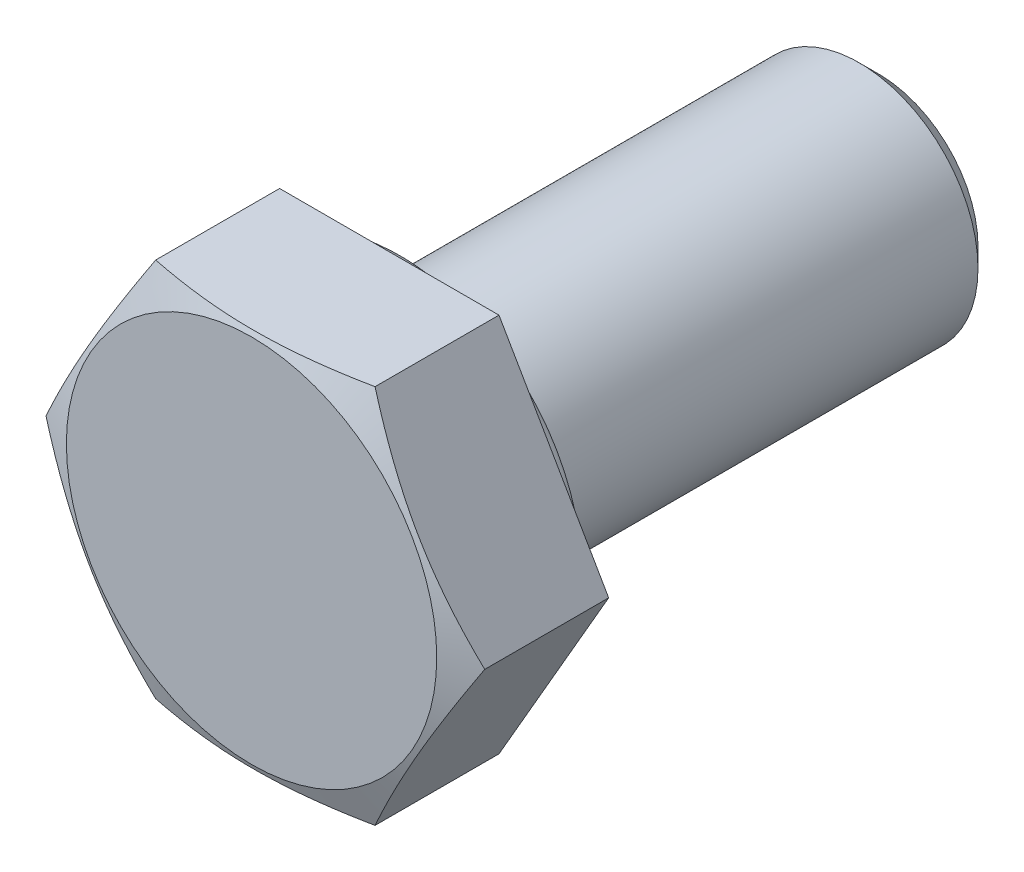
ISO-10303-21;
HEADER;
FILE_DESCRIPTION(('STEP AP214'),'2;1');
FILE_NAME('part.step','',(''),(''),'','','');
FILE_SCHEMA(('AUTOMOTIVE_DESIGN { 1 0 10303 214 1 1 1 1 }'));
ENDSEC;
DATA;
#1=APPLICATION_CONTEXT('core data for automotive mechanical design processes');
#2=APPLICATION_PROTOCOL_DEFINITION('international standard','automotive_design',2000,#1);
#3=PRODUCT_CONTEXT('',#1,'mechanical');
#4=PRODUCT('Part','Part','',(#3));
#5=PRODUCT_RELATED_PRODUCT_CATEGORY('part','',(#4));
#6=PRODUCT_DEFINITION_FORMATION('','',#4);
#7=PRODUCT_DEFINITION_CONTEXT('part definition',#1,'design');
#8=PRODUCT_DEFINITION('design','',#6,#7);
#9=PRODUCT_DEFINITION_SHAPE('','',#8);
#10=(LENGTH_UNIT() NAMED_UNIT(*) SI_UNIT(.MILLI.,.METRE.));
#11=(NAMED_UNIT(*) PLANE_ANGLE_UNIT() SI_UNIT($,.RADIAN.));
#12=(NAMED_UNIT(*) SI_UNIT($,.STERADIAN.) SOLID_ANGLE_UNIT());
#13=UNCERTAINTY_MEASURE_WITH_UNIT(LENGTH_MEASURE(1.E-05),#10,'distance_accuracy_value','');
#14=(GEOMETRIC_REPRESENTATION_CONTEXT(3) GLOBAL_UNCERTAINTY_ASSIGNED_CONTEXT((#13)) GLOBAL_UNIT_ASSIGNED_CONTEXT((#10,
#11,#12)) REPRESENTATION_CONTEXT('',''));
#15=CARTESIAN_POINT('',(0.,0.,0.));
#16=DIRECTION('',(0.,0.,1.));
#17=DIRECTION('',(1.,0.,0.));
#18=AXIS2_PLACEMENT_3D('',#15,#16,#17);
#19=CARTESIAN_POINT('',(0.,0.,6.4));
#20=DIRECTION('',(0.,0.,1.));
#21=DIRECTION('',(1.,0.,0.));
#22=AXIS2_PLACEMENT_3D('',#19,#20,#21);
#23=CYLINDRICAL_SURFACE('',#22,5.);
#24=CARTESIAN_POINT('',(0.,0.,-19.19));
#25=DIRECTION('',(0.,0.,1.));
#26=DIRECTION('',(1.,0.,0.));
#27=AXIS2_PLACEMENT_3D('',#24,#25,#26);
#28=CIRCLE('',#27,5.);
#29=CARTESIAN_POINT('',(5.,0.,-19.19));
#30=VERTEX_POINT('',#29);
#31=EDGE_CURVE('E9',#30,#30,#28,.T.);
#32=ORIENTED_EDGE('',*,*,#31,.T.);
#33=EDGE_LOOP('',(#32));
#34=FACE_BOUND('',#33,.T.);
#35=CARTESIAN_POINT('',(0.,0.,-1.5));
#36=DIRECTION('',(0.,0.,1.));
#37=DIRECTION('',(1.,0.,0.));
#38=AXIS2_PLACEMENT_3D('',#35,#36,#37);
#39=CIRCLE('',#38,5.);
#40=CARTESIAN_POINT('',(5.,0.,-1.5));
#41=VERTEX_POINT('',#40);
#42=EDGE_CURVE('E69',#41,#41,#39,.T.);
#43=ORIENTED_EDGE('',*,*,#42,.F.);
#44=EDGE_LOOP('',(#43));
#45=FACE_BOUND('',#44,.T.);
#46=ADVANCED_FACE('F14',(#34,#45),#23,.T.);
#47=CARTESIAN_POINT('',(0.,7.835,0.6));
#48=DIRECTION('',(0.,0.,1.));
#49=DIRECTION('',(1.,0.,0.));
#50=AXIS2_PLACEMENT_3D('',#47,#48,#49);
#51=PLANE('',#50);
#52=CARTESIAN_POINT('',(0.,0.,0.6));
#53=DIRECTION('',(0.,0.,1.));
#54=DIRECTION('',(1.,0.,0.));
#55=AXIS2_PLACEMENT_3D('',#52,#53,#54);
#56=CIRCLE('',#55,7.835);
#57=CARTESIAN_POINT('',(7.835,0.,0.6));
#58=VERTEX_POINT('',#57);
#59=EDGE_CURVE('E203',#58,#58,#56,.T.);
#60=ORIENTED_EDGE('',*,*,#59,.T.);
#61=EDGE_LOOP('',(#60));
#62=FACE_BOUND('',#61,.T.);
#63=DIRECTION('',(-1.,0.,0.));
#64=VECTOR('',#63,1.);
#65=CARTESIAN_POINT('',(0.,-7.99999626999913,0.6));
#66=LINE('',#65,#64);
#67=CARTESIAN_POINT('',(4.6188,-7.99999626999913,0.6));
#68=VERTEX_POINT('',#67);
#69=CARTESIAN_POINT('',(-4.6188,-7.99999626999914,0.6));
#70=VERTEX_POINT('',#69);
#71=EDGE_CURVE('E189',#68,#70,#66,.T.);
#72=ORIENTED_EDGE('',*,*,#71,.T.);
#73=DIRECTION('',(-0.5,0.866025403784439,0.));
#74=VECTOR('',#73,1.);
#75=CARTESIAN_POINT('',(-10.3208545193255,1.87625186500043,0.6));
#76=LINE('',#75,#74);
#77=CARTESIAN_POINT('',(-9.2376,0.,0.6));
#78=VERTEX_POINT('',#77);
#79=EDGE_CURVE('E77',#70,#78,#76,.T.);
#80=ORIENTED_EDGE('',*,*,#79,.T.);
#81=DIRECTION('',(0.5,0.866025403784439,0.));
#82=VECTOR('',#81,1.);
#83=CARTESIAN_POINT('',(-3.53554548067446,9.87624813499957,0.6));
#84=LINE('',#83,#82);
#85=CARTESIAN_POINT('',(-4.6188,7.99999626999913,0.6));
#86=VERTEX_POINT('',#85);
#87=EDGE_CURVE('E197',#78,#86,#84,.T.);
#88=ORIENTED_EDGE('',*,*,#87,.T.);
#89=DIRECTION('',(1.,0.,0.));
#90=VECTOR('',#89,1.);
#91=CARTESIAN_POINT('',(0.,7.99999626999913,0.6));
#92=LINE('',#91,#90);
#93=CARTESIAN_POINT('',(4.6188,7.99999626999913,0.6));
#94=VERTEX_POINT('',#93);
#95=EDGE_CURVE('E195',#86,#94,#92,.T.);
#96=ORIENTED_EDGE('',*,*,#95,.T.);
#97=DIRECTION('',(0.5,-0.866025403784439,0.));
#98=VECTOR('',#97,1.);
#99=CARTESIAN_POINT('',(3.53554548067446,9.87624813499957,0.6));
#100=LINE('',#99,#98);
#101=CARTESIAN_POINT('',(9.2376,0.,0.6));
#102=VERTEX_POINT('',#101);
#103=EDGE_CURVE('E180',#94,#102,#100,.T.);
#104=ORIENTED_EDGE('',*,*,#103,.T.);
#105=DIRECTION('',(-0.5,-0.866025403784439,0.));
#106=VECTOR('',#105,1.);
#107=CARTESIAN_POINT('',(10.3208545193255,1.87625186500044,0.6));
#108=LINE('',#107,#106);
#109=EDGE_CURVE('E191',#102,#68,#108,.T.);
#110=ORIENTED_EDGE('',*,*,#109,.T.);
#111=EDGE_LOOP('',(#72,#80,#88,#96,#104,#110));
#112=FACE_BOUND('',#111,.T.);
#113=ADVANCED_FACE('F121',(#62,#112),#51,.F.);
#114=CARTESIAN_POINT('',(0.,5.,-1.5));
#115=DIRECTION('',(0.,0.,-1.));
#116=DIRECTION('',(-1.,0.,0.));
#117=AXIS2_PLACEMENT_3D('',#114,#115,#116);
#118=PLANE('',#117);
#119=CARTESIAN_POINT('',(0.,0.,-1.5));
#120=DIRECTION('',(0.,0.,1.));
#121=DIRECTION('',(1.,0.,0.));
#122=AXIS2_PLACEMENT_3D('',#119,#120,#121);
#123=CIRCLE('',#122,4.188125);
#124=CARTESIAN_POINT('',(4.188125,0.,-1.5));
#125=VERTEX_POINT('',#124);
#126=EDGE_CURVE('E133',#125,#125,#123,.T.);
#127=ORIENTED_EDGE('',*,*,#126,.F.);
#128=EDGE_LOOP('',(#127));
#129=FACE_BOUND('',#128,.T.);
#130=ORIENTED_EDGE('',*,*,#42,.T.);
#131=EDGE_LOOP('',(#130));
#132=FACE_BOUND('',#131,.T.);
#133=ADVANCED_FACE('F126',(#129,#132),#118,.F.);
#134=CARTESIAN_POINT('',(0.,0.,-1.5));
#135=DIRECTION('',(0.,0.,1.));
#136=DIRECTION('',(1.,0.,0.));
#137=AXIS2_PLACEMENT_3D('',#134,#135,#136);
#138=CONICAL_SURFACE('',#137,4.188125,1.0471975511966);
#139=CARTESIAN_POINT('',(0.,0.,-1.03126375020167));
#140=DIRECTION('',(0.,0.,1.));
#141=DIRECTION('',(1.,0.,0.));
#142=AXIS2_PLACEMENT_3D('',#139,#140,#141);
#143=CIRCLE('',#142,5.);
#144=CARTESIAN_POINT('',(5.,0.,-1.03126375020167));
#145=VERTEX_POINT('',#144);
#146=EDGE_CURVE('E136',#145,#145,#143,.T.);
#147=ORIENTED_EDGE('',*,*,#146,.F.);
#148=EDGE_LOOP('',(#147));
#149=FACE_BOUND('',#148,.T.);
#150=ORIENTED_EDGE('',*,*,#126,.T.);
#151=EDGE_LOOP('',(#150));
#152=FACE_BOUND('',#151,.T.);
#153=ADVANCED_FACE('F219',(#149,#152),#138,.T.);
#154=CARTESIAN_POINT('',(0.,0.,6.4));
#155=DIRECTION('',(0.,0.,1.));
#156=DIRECTION('',(1.,0.,0.));
#157=AXIS2_PLACEMENT_3D('',#154,#155,#156);
#158=CYLINDRICAL_SURFACE('',#157,5.);
#159=CARTESIAN_POINT('',(0.,0.,-0.5));
#160=DIRECTION('',(0.,0.,1.));
#161=DIRECTION('',(1.,0.,0.));
#162=AXIS2_PLACEMENT_3D('',#159,#160,#161);
#163=CIRCLE('',#162,5.);
#164=CARTESIAN_POINT('',(5.,0.,-0.5));
#165=VERTEX_POINT('',#164);
#166=EDGE_CURVE('E212',#165,#165,#163,.T.);
#167=ORIENTED_EDGE('',*,*,#166,.F.);
#168=EDGE_LOOP('',(#167));
#169=FACE_BOUND('',#168,.T.);
#170=ORIENTED_EDGE('',*,*,#146,.T.);
#171=EDGE_LOOP('',(#170));
#172=FACE_BOUND('',#171,.T.);
#173=ADVANCED_FACE('F217',(#169,#172),#158,.T.);
#174=CARTESIAN_POINT('',(0.,0.,-0.5));
#175=DIRECTION('',(0.,0.,1.));
#176=DIRECTION('',(1.,0.,0.));
#177=AXIS2_PLACEMENT_3D('',#174,#175,#176);
#178=TOROIDAL_SURFACE('',#177,5.5,0.5);
#179=ORIENTED_EDGE('',*,*,#166,.T.);
#180=EDGE_LOOP('',(#179));
#181=FACE_BOUND('',#180,.T.);
#182=CARTESIAN_POINT('',(0.,0.,0.));
#183=DIRECTION('',(0.,0.,1.));
#184=DIRECTION('',(1.,0.,0.));
#185=AXIS2_PLACEMENT_3D('',#182,#183,#184);
#186=CIRCLE('',#185,5.5);
#187=CARTESIAN_POINT('',(5.5,0.,0.));
#188=VERTEX_POINT('',#187);
#189=EDGE_CURVE('E209',#188,#188,#186,.T.);
#190=ORIENTED_EDGE('',*,*,#189,.F.);
#191=EDGE_LOOP('',(#190));
#192=FACE_BOUND('',#191,.T.);
#193=ADVANCED_FACE('F231',(#181,#192),#178,.F.);
#194=CARTESIAN_POINT('',(0.,5.5,0.));
#195=DIRECTION('',(0.,0.,1.));
#196=DIRECTION('',(1.,0.,0.));
#197=AXIS2_PLACEMENT_3D('',#194,#195,#196);
#198=PLANE('',#197);
#199=CARTESIAN_POINT('',(0.,0.,0.));
#200=DIRECTION('',(0.,0.,1.));
#201=DIRECTION('',(1.,0.,0.));
#202=AXIS2_PLACEMENT_3D('',#199,#200,#201);
#203=CIRCLE('',#202,7.235);
#204=CARTESIAN_POINT('',(7.235,0.,0.));
#205=VERTEX_POINT('',#204);
#206=EDGE_CURVE('E206',#205,#205,#203,.T.);
#207=ORIENTED_EDGE('',*,*,#206,.F.);
#208=EDGE_LOOP('',(#207));
#209=FACE_BOUND('',#208,.T.);
#210=ORIENTED_EDGE('',*,*,#189,.T.);
#211=EDGE_LOOP('',(#210));
#212=FACE_BOUND('',#211,.T.);
#213=ADVANCED_FACE('F235',(#209,#212),#198,.F.);
#214=CARTESIAN_POINT('',(0.,0.,0.6));
#215=DIRECTION('',(0.,0.,1.));
#216=DIRECTION('',(1.,0.,0.));
#217=AXIS2_PLACEMENT_3D('',#214,#215,#216);
#218=TOROIDAL_SURFACE('',#217,7.235,0.6);
#219=ORIENTED_EDGE('',*,*,#59,.F.);
#220=EDGE_LOOP('',(#219));
#221=FACE_BOUND('',#220,.T.);
#222=ORIENTED_EDGE('',*,*,#206,.T.);
#223=EDGE_LOOP('',(#222));
#224=FACE_BOUND('',#223,.T.);
#225=ADVANCED_FACE('F104',(#221,#224),#218,.T.);
#226=CARTESIAN_POINT('',(-4.6188,-7.99999626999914,-25.));
#227=DIRECTION('',(0.866025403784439,0.5,0.));
#228=DIRECTION('',(0.5,-0.866025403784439,0.));
#229=AXIS2_PLACEMENT_3D('',#226,#227,#228);
#230=PLANE('',#229);
#231=ORIENTED_EDGE('',*,*,#79,.F.);
#232=DIRECTION('',(0.,0.,1.));
#233=VECTOR('',#232,1.);
#234=CARTESIAN_POINT('',(-4.6188,-7.99999626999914,-25.));
#235=LINE('',#234,#233);
#236=CARTESIAN_POINT('',(-4.6188,-7.99999626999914,5.81818181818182));
#237=VERTEX_POINT('',#236);
#238=EDGE_CURVE('E28',#70,#237,#235,.T.);
#239=ORIENTED_EDGE('',*,*,#238,.T.);
#240=CARTESIAN_POINT('',(-9.23760011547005,2.E-07,5.81818177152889));
#241=CARTESIAN_POINT('',(-9.07623171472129,-0.27949806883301,5.88338258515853));
#242=CARTESIAN_POINT('',(-8.91433070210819,-0.559918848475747,5.94367122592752));
#243=CARTESIAN_POINT('',(-8.58945812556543,-1.12261465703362,6.0525711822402));
#244=CARTESIAN_POINT('',(-8.42648599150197,-1.40489067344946,6.10117565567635));
#245=CARTESIAN_POINT('',(-8.09970314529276,-1.97089516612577,6.184761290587));
#246=CARTESIAN_POINT('',(-7.93589269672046,-2.25462318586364,6.21974649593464));
#247=CARTESIAN_POINT('',(-7.60766331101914,-2.82313315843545,6.27447232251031));
#248=CARTESIAN_POINT('',(-7.44324451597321,-3.10791486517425,6.2942163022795));
#249=CARTESIAN_POINT('',(-7.116909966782,-3.67314288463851,6.31723187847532));
#250=CARTESIAN_POINT('',(-6.95499911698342,-3.95358070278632,6.3207774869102));
#251=CARTESIAN_POINT('',(-6.63127309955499,-4.51429061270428,6.31195075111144));
#252=CARTESIAN_POINT('',(-6.46945794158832,-4.79456268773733,6.29957700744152));
#253=CARTESIAN_POINT('',(-6.14641204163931,-5.35409459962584,6.25957675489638));
#254=CARTESIAN_POINT('',(-5.98518099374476,-5.63335496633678,6.23195993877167));
#255=CARTESIAN_POINT('',(-5.66348869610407,-6.19054237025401,6.16281191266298));
#256=CARTESIAN_POINT('',(-5.50302737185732,-6.46846953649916,6.12128207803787));
#257=CARTESIAN_POINT('',(-5.28250881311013,-6.85041888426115,6.05563542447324));
#258=CARTESIAN_POINT('',(-5.22204978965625,-6.95513698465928,6.03674445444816));
#259=CARTESIAN_POINT('',(-5.10127443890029,-7.16432602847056,5.99731748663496));
#260=CARTESIAN_POINT('',(-5.04095809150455,-7.26879700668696,5.9767817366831));
#261=CARTESIAN_POINT('',(-4.92025661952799,-7.4778580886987,5.93408711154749));
#262=CARTESIAN_POINT('',(-4.85987196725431,-7.5824473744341,5.91192291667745));
#263=CARTESIAN_POINT('',(-4.73923496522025,-7.79139679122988,5.86612783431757));
#264=CARTESIAN_POINT('',(-4.67898263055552,-7.89575689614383,5.84249678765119));
#265=CARTESIAN_POINT('',(-4.61879988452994,-7.99999646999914,5.81818177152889));
#266=B_SPLINE_CURVE_WITH_KNOTS('',3,(#240,#241,#242,#243,#244,#245,#246,#247,#248,#249,#250,
#251,#252,#253,#254,#255,#256,#257,#258,#259,#260,#261,#262,#263,#264,#265),.UNSPECIFIED.,.F.,
.F.,(4,2,2,2,2,2,2,2,2,2,2,2,4),(0.,0.987840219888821,1.97625750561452,2.96438108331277,
3.95228685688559,4.92341776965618,5.89463405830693,6.86523348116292,7.83573698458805,
8.20288448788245,8.56997677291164,8.93832669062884,9.30671665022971),.UNSPECIFIED.);
#267=CARTESIAN_POINT('',(-9.2376,0.,5.81818181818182));
#268=VERTEX_POINT('',#267);
#269=EDGE_CURVE('E74',#268,#237,#266,.T.);
#270=ORIENTED_EDGE('',*,*,#269,.F.);
#271=DIRECTION('',(0.,0.,1.));
#272=VECTOR('',#271,1.);
#273=CARTESIAN_POINT('',(-9.2376,0.,-25.));
#274=LINE('',#273,#272);
#275=EDGE_CURVE('E183',#78,#268,#274,.T.);
#276=ORIENTED_EDGE('',*,*,#275,.F.);
#277=EDGE_LOOP('',(#231,#239,#270,#276));
#278=FACE_BOUND('',#277,.T.);
#279=ADVANCED_FACE('F72',(#278),#230,.F.);
#280=CARTESIAN_POINT('',(-9.2376,0.,-25.));
#281=DIRECTION('',(0.866025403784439,-0.5,0.));
#282=DIRECTION('',(-0.5,-0.866025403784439,0.));
#283=AXIS2_PLACEMENT_3D('',#280,#281,#282);
#284=PLANE('',#283);
#285=ORIENTED_EDGE('',*,*,#87,.F.);
#286=ORIENTED_EDGE('',*,*,#275,.T.);
#287=CARTESIAN_POINT('',(-4.61879988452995,7.99999646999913,5.81818177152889));
#288=CARTESIAN_POINT('',(-4.78016828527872,7.72049820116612,5.88338258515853));
#289=CARTESIAN_POINT('',(-4.94206929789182,7.44007742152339,5.94367122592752));
#290=CARTESIAN_POINT('',(-5.26694187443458,6.87738161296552,6.0525711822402));
#291=CARTESIAN_POINT('',(-5.42991400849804,6.59510559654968,6.10117565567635));
#292=CARTESIAN_POINT('',(-5.75669685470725,6.02910110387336,6.184761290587));
#293=CARTESIAN_POINT('',(-5.92050730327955,5.7453730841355,6.21974649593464));
#294=CARTESIAN_POINT('',(-6.24873668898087,5.17686311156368,6.27447232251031));
#295=CARTESIAN_POINT('',(-6.4131554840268,4.89208140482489,6.2942163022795));
#296=CARTESIAN_POINT('',(-6.73949003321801,4.32685338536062,6.31723187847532));
#297=CARTESIAN_POINT('',(-6.90140088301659,4.04641556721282,6.3207774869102));
#298=CARTESIAN_POINT('',(-7.22512690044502,3.48570565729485,6.31195075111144));
#299=CARTESIAN_POINT('',(-7.38694205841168,3.20543358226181,6.29957700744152));
#300=CARTESIAN_POINT('',(-7.7099879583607,2.64590167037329,6.25957675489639));
#301=CARTESIAN_POINT('',(-7.87121900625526,2.36664130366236,6.23195993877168));
#302=CARTESIAN_POINT('',(-8.19291130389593,1.80945389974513,6.16281191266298));
#303=CARTESIAN_POINT('',(-8.35337262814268,1.53152673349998,6.12128207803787));
#304=CARTESIAN_POINT('',(-8.57389118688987,1.14957738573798,6.05563542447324));
#305=CARTESIAN_POINT('',(-8.63435021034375,1.04485928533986,6.03674445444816));
#306=CARTESIAN_POINT('',(-8.75512556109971,0.835670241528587,5.99731748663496));
#307=CARTESIAN_POINT('',(-8.81544190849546,0.731199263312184,5.9767817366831));
#308=CARTESIAN_POINT('',(-8.93614338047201,0.52213818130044,5.93408711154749));
#309=CARTESIAN_POINT('',(-8.99652803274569,0.417548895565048,5.91192291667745));
#310=CARTESIAN_POINT('',(-9.11716503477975,0.208599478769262,5.86612783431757));
#311=CARTESIAN_POINT('',(-9.17741736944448,0.104239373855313,5.84249678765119));
#312=CARTESIAN_POINT('',(-9.23760011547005,-1.99999999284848E-07,5.81818177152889));
#313=B_SPLINE_CURVE_WITH_KNOTS('',3,(#287,#288,#289,#290,#291,#292,#293,#294,#295,#296,#297,
#298,#299,#300,#301,#302,#303,#304,#305,#306,#307,#308,#309,#310,#311,#312),.UNSPECIFIED.,.F.,
.F.,(4,2,2,2,2,2,2,2,2,2,2,2,4),(0.,0.987840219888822,1.97625750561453,2.96438108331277,
3.95228685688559,4.92341776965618,5.89463405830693,6.86523348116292,7.83573698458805,
8.20288448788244,8.56997677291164,8.93832669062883,9.3067166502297),.UNSPECIFIED.);
#314=CARTESIAN_POINT('',(-4.6188,7.99999626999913,5.81818181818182));
#315=VERTEX_POINT('',#314);
#316=EDGE_CURVE('E83',#315,#268,#313,.T.);
#317=ORIENTED_EDGE('',*,*,#316,.F.);
#318=DIRECTION('',(0.,0.,1.));
#319=VECTOR('',#318,1.);
#320=CARTESIAN_POINT('',(-4.6188,7.99999626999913,-25.));
#321=LINE('',#320,#319);
#322=EDGE_CURVE('E176',#86,#315,#321,.T.);
#323=ORIENTED_EDGE('',*,*,#322,.F.);
#324=EDGE_LOOP('',(#285,#286,#317,#323));
#325=FACE_BOUND('',#324,.T.);
#326=ADVANCED_FACE('F103',(#325),#284,.F.);
#327=CARTESIAN_POINT('',(-4.6188,7.99999626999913,-25.));
#328=DIRECTION('',(0.,-1.,0.));
#329=DIRECTION('',(-1.,0.,0.));
#330=AXIS2_PLACEMENT_3D('',#327,#328,#329);
#331=PLANE('',#330);
#332=ORIENTED_EDGE('',*,*,#95,.F.);
#333=ORIENTED_EDGE('',*,*,#322,.T.);
#334=CARTESIAN_POINT('',(-12.5719547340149,7.99999626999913,3.5298273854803));
#335=CARTESIAN_POINT('',(-12.1983187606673,7.99999626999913,3.65714990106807));
#336=CARTESIAN_POINT('',(-11.8241969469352,7.99999626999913,3.78307295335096));
#337=CARTESIAN_POINT('',(-11.0747197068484,7.99999626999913,4.03131289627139));
#338=CARTESIAN_POINT('',(-10.6993641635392,7.99999626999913,4.15362943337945));
#339=CARTESIAN_POINT('',(-9.94620503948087,7.99999626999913,4.39415137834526));
#340=CARTESIAN_POINT('',(-9.56839757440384,7.99999626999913,4.51234466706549));
#341=CARTESIAN_POINT('',(-8.81107863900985,7.99999626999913,4.74312776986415));
#342=CARTESIAN_POINT('',(-8.43156721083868,7.99999626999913,4.8557177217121));
#343=CARTESIAN_POINT('',(-7.67246142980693,7.99999626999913,5.07327543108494));
#344=CARTESIAN_POINT('',(-7.29287748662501,7.99999626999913,5.17827932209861));
#345=CARTESIAN_POINT('',(-6.53133965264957,7.99999626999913,5.37943691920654));
#346=CARTESIAN_POINT('',(-6.14938567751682,7.99999626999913,5.47559030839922));
#347=CARTESIAN_POINT('',(-5.38308686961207,7.99999626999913,5.65661961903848));
#348=CARTESIAN_POINT('',(-4.99874399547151,7.99999626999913,5.74150375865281));
#349=CARTESIAN_POINT('',(-4.22720948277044,7.99999626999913,5.89721151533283));
#350=CARTESIAN_POINT('',(-3.84001810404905,7.99999626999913,5.96803639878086));
#351=CARTESIAN_POINT('',(-3.15468340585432,7.99999626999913,6.07772100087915));
#352=CARTESIAN_POINT('',(-2.85711851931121,7.99999626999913,6.12017938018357));
#353=CARTESIAN_POINT('',(-2.26056309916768,7.99999626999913,6.19360511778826));
#354=CARTESIAN_POINT('',(-1.9615726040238,7.99999626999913,6.22457278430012));
#355=CARTESIAN_POINT('',(-1.36269467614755,7.99999626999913,6.27378877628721));
#356=CARTESIAN_POINT('',(-1.06280781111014,7.99999626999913,6.29204392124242));
#357=CARTESIAN_POINT('',(-0.462511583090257,7.99999626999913,6.31505964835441));
#358=CARTESIAN_POINT('',(-0.162102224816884,7.99999626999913,6.31982035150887));
#359=CARTESIAN_POINT('',(0.438718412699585,7.99999626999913,6.31562600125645));
#360=CARTESIAN_POINT('',(0.739129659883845,7.99999626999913,6.30666642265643));
#361=CARTESIAN_POINT('',(1.33925291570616,7.99999626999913,6.27543464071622));
#362=CARTESIAN_POINT('',(1.63896491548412,7.99999626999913,6.25316226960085));
#363=CARTESIAN_POINT('',(2.23737206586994,7.99999626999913,6.19623962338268));
#364=CARTESIAN_POINT('',(2.53606652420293,7.99999626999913,6.16158216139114));
#365=CARTESIAN_POINT('',(3.13194924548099,7.99999626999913,6.08119272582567));
#366=CARTESIAN_POINT('',(3.42913747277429,7.99999626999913,6.03546049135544));
#367=CARTESIAN_POINT('',(4.11363187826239,7.99999626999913,5.91871471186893));
#368=CARTESIAN_POINT('',(4.50034816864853,7.99999626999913,5.84425774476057));
#369=CARTESIAN_POINT('',(5.27095740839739,7.99999626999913,5.68198807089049));
#370=CARTESIAN_POINT('',(5.65485012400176,7.99999626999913,5.59417427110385));
#371=CARTESIAN_POINT('',(6.42025470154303,7.99999626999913,5.40788960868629));
#372=CARTESIAN_POINT('',(6.80176506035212,7.99999626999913,5.30941262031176));
#373=CARTESIAN_POINT('',(7.56249587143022,7.99999626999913,5.10408437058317));
#374=CARTESIAN_POINT('',(7.94171640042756,7.99999626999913,4.99723339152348));
#375=CARTESIAN_POINT('',(8.69926332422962,7.99999626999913,4.77660865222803));
#376=CARTESIAN_POINT('',(9.07758437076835,7.99999626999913,4.66281661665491));
#377=CARTESIAN_POINT('',(9.83259783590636,7.99999626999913,4.42994140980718));
#378=CARTESIAN_POINT('',(10.2092902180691,7.99999626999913,4.31085812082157));
#379=CARTESIAN_POINT('',(10.9604179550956,7.99999626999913,4.06875367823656));
#380=CARTESIAN_POINT('',(11.3348565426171,7.99999626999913,3.94574252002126));
#381=CARTESIAN_POINT('',(12.0825558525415,7.99999626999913,3.69629462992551));
#382=CARTESIAN_POINT('',(12.4558166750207,7.99999626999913,3.56985819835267));
#383=CARTESIAN_POINT('',(12.8286123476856,7.99999626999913,3.44208796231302));
#384=B_SPLINE_CURVE_WITH_KNOTS('',3,(#334,#335,#336,#337,#338,#339,#340,#341,#342,#343,#344,
#345,#346,#347,#348,#349,#350,#351,#352,#353,#354,#355,#356,#357,#358,#359,#360,#361,#362,#363,
#364,#365,#366,#367,#368,#369,#370,#371,#372,#373,#374,#375,#376,#377,#378,#379,#380,#381,#382,
#383),.UNSPECIFIED.,.F.,.F.,(4,2,2,2,2,2,2,2,2,2,2,2,2,2,2,2,2,2,2,2,2,2,2,2,4),(0.,
1.18421166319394,2.36853902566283,3.55609567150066,4.74362310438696,5.92505950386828,
7.10653818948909,8.28715048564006,9.46765639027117,10.3692009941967,11.2707214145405,
12.1717578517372,13.0727862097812,13.9741118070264,14.8754487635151,15.777309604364,
16.6791916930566,17.8603375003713,19.0415800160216,20.2235047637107,21.4053896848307,
22.5905333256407,23.7757033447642,24.9580661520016,26.1403256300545),.UNSPECIFIED.);
#385=CARTESIAN_POINT('',(4.6188,7.99999626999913,5.81818181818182));
#386=VERTEX_POINT('',#385);
#387=EDGE_CURVE('E86',#386,#315,#384,.F.);
#388=ORIENTED_EDGE('',*,*,#387,.F.);
#389=DIRECTION('',(0.,0.,1.));
#390=VECTOR('',#389,1.);
#391=CARTESIAN_POINT('',(4.6188,7.99999626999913,-25.));
#392=LINE('',#391,#390);
#393=EDGE_CURVE('E173',#94,#386,#392,.T.);
#394=ORIENTED_EDGE('',*,*,#393,.F.);
#395=EDGE_LOOP('',(#332,#333,#388,#394));
#396=FACE_BOUND('',#395,.T.);
#397=ADVANCED_FACE('F158',(#396),#331,.F.);
#398=CARTESIAN_POINT('',(4.6188,7.99999626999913,-25.));
#399=DIRECTION('',(-0.866025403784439,-0.5,0.));
#400=DIRECTION('',(-0.5,0.866025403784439,0.));
#401=AXIS2_PLACEMENT_3D('',#398,#399,#400);
#402=PLANE('',#401);
#403=ORIENTED_EDGE('',*,*,#103,.F.);
#404=ORIENTED_EDGE('',*,*,#393,.T.);
#405=CARTESIAN_POINT('',(9.23760011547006,-2.00000002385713E-07,5.81818177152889));
#406=CARTESIAN_POINT('',(9.07623171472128,0.279498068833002,5.88338258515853));
#407=CARTESIAN_POINT('',(8.91433070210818,0.559918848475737,5.94367122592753));
#408=CARTESIAN_POINT('',(8.58945812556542,1.12261465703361,6.0525711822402));
#409=CARTESIAN_POINT('',(8.42648599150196,1.40489067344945,6.10117565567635));
#410=CARTESIAN_POINT('',(8.09970314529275,1.97089516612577,6.18476129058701));
#411=CARTESIAN_POINT('',(7.93589269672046,2.25462318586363,6.21974649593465));
#412=CARTESIAN_POINT('',(7.60766331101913,2.82313315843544,6.27447232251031));
#413=CARTESIAN_POINT('',(7.44324451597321,3.10791486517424,6.29421630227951));
#414=CARTESIAN_POINT('',(7.116909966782,3.67314288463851,6.31723187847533));
#415=CARTESIAN_POINT('',(6.95499911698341,3.95358070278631,6.3207774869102));
#416=CARTESIAN_POINT('',(6.63127309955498,4.51429061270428,6.31195075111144));
#417=CARTESIAN_POINT('',(6.46945794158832,4.79456268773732,6.29957700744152));
#418=CARTESIAN_POINT('',(6.1464120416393,5.35409459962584,6.25957675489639));
#419=CARTESIAN_POINT('',(5.98518099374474,5.63335496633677,6.23195993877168));
#420=CARTESIAN_POINT('',(5.66348869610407,6.19054237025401,6.16281191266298));
#421=CARTESIAN_POINT('',(5.50302737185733,6.46846953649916,6.12128207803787));
#422=CARTESIAN_POINT('',(5.28250881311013,6.85041888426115,6.05563542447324));
#423=CARTESIAN_POINT('',(5.22204978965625,6.95513698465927,6.03674445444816));
#424=CARTESIAN_POINT('',(5.10127443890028,7.16432602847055,5.99731748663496));
#425=CARTESIAN_POINT('',(5.04095809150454,7.26879700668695,5.97678173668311));
#426=CARTESIAN_POINT('',(4.92025661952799,7.47785808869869,5.93408711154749));
#427=CARTESIAN_POINT('',(4.85987196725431,7.58244737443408,5.91192291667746));
#428=CARTESIAN_POINT('',(4.73923496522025,7.79139679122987,5.86612783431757));
#429=CARTESIAN_POINT('',(4.67898263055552,7.89575689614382,5.8424967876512));
#430=CARTESIAN_POINT('',(4.61879988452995,7.99999646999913,5.81818177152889));
#431=B_SPLINE_CURVE_WITH_KNOTS('',3,(#405,#406,#407,#408,#409,#410,#411,#412,#413,#414,#415,
#416,#417,#418,#419,#420,#421,#422,#423,#424,#425,#426,#427,#428,#429,#430),.UNSPECIFIED.,.F.,
.F.,(4,2,2,2,2,2,2,2,2,2,2,2,4),(0.,0.987840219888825,1.97625750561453,2.96438108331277,
3.95228685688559,4.92341776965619,5.89463405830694,6.86523348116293,7.83573698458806,
8.20288448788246,8.56997677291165,8.93832669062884,9.30671665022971),.UNSPECIFIED.);
#432=CARTESIAN_POINT('',(9.2376,0.,5.81818181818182));
#433=VERTEX_POINT('',#432);
#434=EDGE_CURVE('E161',#433,#386,#431,.T.);
#435=ORIENTED_EDGE('',*,*,#434,.F.);
#436=DIRECTION('',(0.,0.,1.));
#437=VECTOR('',#436,1.);
#438=CARTESIAN_POINT('',(9.2376,0.,-25.));
#439=LINE('',#438,#437);
#440=EDGE_CURVE('E181',#102,#433,#439,.T.);
#441=ORIENTED_EDGE('',*,*,#440,.F.);
#442=EDGE_LOOP('',(#403,#404,#435,#441));
#443=FACE_BOUND('',#442,.T.);
#444=ADVANCED_FACE('F154',(#443),#402,.F.);
#445=CARTESIAN_POINT('',(9.2376,0.,-25.));
#446=DIRECTION('',(-0.866025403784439,0.5,0.));
#447=DIRECTION('',(0.5,0.866025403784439,0.));
#448=AXIS2_PLACEMENT_3D('',#445,#446,#447);
#449=PLANE('',#448);
#450=ORIENTED_EDGE('',*,*,#109,.F.);
#451=ORIENTED_EDGE('',*,*,#440,.T.);
#452=CARTESIAN_POINT('',(4.61879988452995,-7.99999646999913,5.81818177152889));
#453=CARTESIAN_POINT('',(4.78016828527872,-7.72049820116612,5.88338258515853));
#454=CARTESIAN_POINT('',(4.94206929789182,-7.44007742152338,5.94367122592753));
#455=CARTESIAN_POINT('',(5.26694187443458,-6.87738161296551,6.0525711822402));
#456=CARTESIAN_POINT('',(5.42991400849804,-6.59510559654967,6.10117565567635));
#457=CARTESIAN_POINT('',(5.75669685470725,-6.02910110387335,6.18476129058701));
#458=CARTESIAN_POINT('',(5.92050730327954,-5.74537308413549,6.21974649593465));
#459=CARTESIAN_POINT('',(6.24873668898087,-5.17686311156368,6.27447232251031));
#460=CARTESIAN_POINT('',(6.41315548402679,-4.89208140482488,6.29421630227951));
#461=CARTESIAN_POINT('',(6.739490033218,-4.32685338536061,6.31723187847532));
#462=CARTESIAN_POINT('',(6.90140088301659,-4.0464155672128,6.3207774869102));
#463=CARTESIAN_POINT('',(7.22512690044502,-3.48570565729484,6.31195075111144));
#464=CARTESIAN_POINT('',(7.38694205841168,-3.2054335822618,6.29957700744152));
#465=CARTESIAN_POINT('',(7.7099879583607,-2.64590167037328,6.25957675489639));
#466=CARTESIAN_POINT('',(7.87121900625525,-2.36664130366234,6.23195993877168));
#467=CARTESIAN_POINT('',(8.19291130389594,-1.80945389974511,6.16281191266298));
#468=CARTESIAN_POINT('',(8.35337262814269,-1.53152673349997,6.12128207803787));
#469=CARTESIAN_POINT('',(8.57389118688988,-1.14957738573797,6.05563542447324));
#470=CARTESIAN_POINT('',(8.63435021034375,-1.04485928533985,6.03674445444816));
#471=CARTESIAN_POINT('',(8.75512556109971,-0.835670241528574,5.99731748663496));
#472=CARTESIAN_POINT('',(8.81544190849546,-0.731199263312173,5.97678173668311));
#473=CARTESIAN_POINT('',(8.93614338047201,-0.522138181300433,5.93408711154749));
#474=CARTESIAN_POINT('',(8.99652803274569,-0.417548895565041,5.91192291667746));
#475=CARTESIAN_POINT('',(9.11716503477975,-0.208599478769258,5.86612783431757));
#476=CARTESIAN_POINT('',(9.17741736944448,-0.104239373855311,5.8424967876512));
#477=CARTESIAN_POINT('',(9.23760011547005,1.99999997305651E-07,5.81818177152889));
#478=B_SPLINE_CURVE_WITH_KNOTS('',3,(#452,#453,#454,#455,#456,#457,#458,#459,#460,#461,#462,
#463,#464,#465,#466,#467,#468,#469,#470,#471,#472,#473,#474,#475,#476,#477),.UNSPECIFIED.,.F.,
.F.,(4,2,2,2,2,2,2,2,2,2,2,2,4),(0.,0.987840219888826,1.97625750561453,2.96438108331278,
3.95228685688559,4.92341776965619,5.89463405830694,6.86523348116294,7.83573698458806,
8.20288448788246,8.56997677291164,8.93832669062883,9.3067166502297),.UNSPECIFIED.);
#479=CARTESIAN_POINT('',(4.6188,-7.99999626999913,5.81818181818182));
#480=VERTEX_POINT('',#479);
#481=EDGE_CURVE('E68',#480,#433,#478,.T.);
#482=ORIENTED_EDGE('',*,*,#481,.F.);
#483=DIRECTION('',(0.,0.,1.));
#484=VECTOR('',#483,1.);
#485=CARTESIAN_POINT('',(4.6188,-7.99999626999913,-25.));
#486=LINE('',#485,#484);
#487=EDGE_CURVE('E33',#68,#480,#486,.T.);
#488=ORIENTED_EDGE('',*,*,#487,.F.);
#489=EDGE_LOOP('',(#450,#451,#482,#488));
#490=FACE_BOUND('',#489,.T.);
#491=ADVANCED_FACE('F117',(#490),#449,.F.);
#492=CARTESIAN_POINT('',(4.6188,-7.99999626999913,-25.));
#493=DIRECTION('',(0.,1.,0.));
#494=DIRECTION('',(1.,0.,0.));
#495=AXIS2_PLACEMENT_3D('',#492,#493,#494);
#496=PLANE('',#495);
#497=ORIENTED_EDGE('',*,*,#71,.F.);
#498=ORIENTED_EDGE('',*,*,#487,.T.);
#499=CARTESIAN_POINT('',(-12.5719547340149,-7.99999626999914,3.52982738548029));
#500=CARTESIAN_POINT('',(-12.1983187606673,-7.99999626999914,3.65714990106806));
#501=CARTESIAN_POINT('',(-11.8241969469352,-7.99999626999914,3.78307295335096));
#502=CARTESIAN_POINT('',(-11.0747197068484,-7.99999626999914,4.03131289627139));
#503=CARTESIAN_POINT('',(-10.6993641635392,-7.99999626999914,4.15362943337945));
#504=CARTESIAN_POINT('',(-9.94620503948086,-7.99999626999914,4.39415137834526));
#505=CARTESIAN_POINT('',(-9.56839757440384,-7.99999626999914,4.51234466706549));
#506=CARTESIAN_POINT('',(-8.81107863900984,-7.99999626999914,4.74312776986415));
#507=CARTESIAN_POINT('',(-8.43156721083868,-7.99999626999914,4.8557177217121));
#508=CARTESIAN_POINT('',(-7.67246142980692,-7.99999626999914,5.07327543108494));
#509=CARTESIAN_POINT('',(-7.292877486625,-7.99999626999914,5.17827932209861));
#510=CARTESIAN_POINT('',(-6.53133965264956,-7.99999626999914,5.37943691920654));
#511=CARTESIAN_POINT('',(-6.14938567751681,-7.99999626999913,5.47559030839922));
#512=CARTESIAN_POINT('',(-5.38308686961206,-7.99999626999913,5.65661961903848));
#513=CARTESIAN_POINT('',(-4.99874399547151,-7.99999626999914,5.74150375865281));
#514=CARTESIAN_POINT('',(-4.22720948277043,-7.99999626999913,5.89721151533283));
#515=CARTESIAN_POINT('',(-3.84001810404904,-7.99999626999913,5.96803639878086));
#516=CARTESIAN_POINT('',(-3.15468340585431,-7.99999626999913,6.07772100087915));
#517=CARTESIAN_POINT('',(-2.8571185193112,-7.99999626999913,6.12017938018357));
#518=CARTESIAN_POINT('',(-2.26056309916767,-7.99999626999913,6.19360511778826));
#519=CARTESIAN_POINT('',(-1.96157260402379,-7.99999626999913,6.22457278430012));
#520=CARTESIAN_POINT('',(-1.36269467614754,-7.99999626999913,6.27378877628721));
#521=CARTESIAN_POINT('',(-1.06280781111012,-7.99999626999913,6.29204392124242));
#522=CARTESIAN_POINT('',(-0.462511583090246,-7.99999626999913,6.31505964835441));
#523=CARTESIAN_POINT('',(-0.162102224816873,-7.99999626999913,6.31982035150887));
#524=CARTESIAN_POINT('',(0.438718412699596,-7.99999626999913,6.31562600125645));
#525=CARTESIAN_POINT('',(0.739129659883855,-7.99999626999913,6.30666642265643));
#526=CARTESIAN_POINT('',(1.33925291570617,-7.99999626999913,6.27543464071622));
#527=CARTESIAN_POINT('',(1.63896491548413,-7.99999626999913,6.25316226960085));
#528=CARTESIAN_POINT('',(2.23737206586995,-7.99999626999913,6.19623962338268));
#529=CARTESIAN_POINT('',(2.53606652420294,-7.99999626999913,6.16158216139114));
#530=CARTESIAN_POINT('',(3.131949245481,-7.99999626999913,6.08119272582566));
#531=CARTESIAN_POINT('',(3.4291374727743,-7.99999626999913,6.03546049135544));
#532=CARTESIAN_POINT('',(4.1136318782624,-7.99999626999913,5.91871471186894));
#533=CARTESIAN_POINT('',(4.50034816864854,-7.99999626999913,5.84425774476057));
#534=CARTESIAN_POINT('',(5.2709574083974,-7.99999626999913,5.68198807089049));
#535=CARTESIAN_POINT('',(5.65485012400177,-7.99999626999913,5.59417427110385));
#536=CARTESIAN_POINT('',(6.42025470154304,-7.99999626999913,5.40788960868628));
#537=CARTESIAN_POINT('',(6.80176506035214,-7.99999626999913,5.30941262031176));
#538=CARTESIAN_POINT('',(7.56249587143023,-7.99999626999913,5.10408437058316));
#539=CARTESIAN_POINT('',(7.94171640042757,-7.99999626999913,4.99723339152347));
#540=CARTESIAN_POINT('',(8.69926332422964,-7.99999626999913,4.77660865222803));
#541=CARTESIAN_POINT('',(9.07758437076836,-7.99999626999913,4.66281661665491));
#542=CARTESIAN_POINT('',(9.83259783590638,-7.99999626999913,4.42994140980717));
#543=CARTESIAN_POINT('',(10.2092902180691,-7.99999626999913,4.31085812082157));
#544=CARTESIAN_POINT('',(10.9604179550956,-7.99999626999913,4.06875367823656));
#545=CARTESIAN_POINT('',(11.3348565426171,-7.99999626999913,3.94574252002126));
#546=CARTESIAN_POINT('',(12.0825558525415,-7.99999626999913,3.69629462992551));
#547=CARTESIAN_POINT('',(12.4558166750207,-7.99999626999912,3.56985819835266));
#548=CARTESIAN_POINT('',(12.8286123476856,-7.99999626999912,3.44208796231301));
#549=B_SPLINE_CURVE_WITH_KNOTS('',3,(#499,#500,#501,#502,#503,#504,#505,#506,#507,#508,#509,
#510,#511,#512,#513,#514,#515,#516,#517,#518,#519,#520,#521,#522,#523,#524,#525,#526,#527,#528,
#529,#530,#531,#532,#533,#534,#535,#536,#537,#538,#539,#540,#541,#542,#543,#544,#545,#546,#547,
#548),.UNSPECIFIED.,.F.,.F.,(4,2,2,2,2,2,2,2,2,2,2,2,2,2,2,2,2,2,2,2,2,2,2,2,4),(0.,
1.18421166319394,2.36853902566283,3.55609567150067,4.74362310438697,5.92505950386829,
7.1065381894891,8.28715048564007,9.46765639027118,10.3692009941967,11.2707214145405,
12.1717578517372,13.0727862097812,13.9741118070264,14.8754487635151,15.777309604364,
16.6791916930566,17.8603375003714,19.0415800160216,20.2235047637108,21.4053896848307,
22.5905333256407,23.7757033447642,24.9580661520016,26.1403256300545),.UNSPECIFIED.);
#550=EDGE_CURVE('E63',#237,#480,#549,.T.);
#551=ORIENTED_EDGE('',*,*,#550,.F.);
#552=ORIENTED_EDGE('',*,*,#238,.F.);
#553=EDGE_LOOP('',(#497,#498,#551,#552));
#554=FACE_BOUND('',#553,.T.);
#555=ADVANCED_FACE('F64',(#554),#496,.F.);
#556=CARTESIAN_POINT('',(0.,7.79754946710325,6.4));
#557=DIRECTION('',(0.,0.,-1.));
#558=DIRECTION('',(-1.,0.,0.));
#559=AXIS2_PLACEMENT_3D('',#556,#557,#558);
#560=PLANE('',#559);
#561=CARTESIAN_POINT('',(0.,0.,6.4));
#562=DIRECTION('',(0.,0.,1.));
#563=DIRECTION('',(1.,0.,0.));
#564=AXIS2_PLACEMENT_3D('',#561,#562,#563);
#565=CIRCLE('',#564,7.79754946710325);
#566=CARTESIAN_POINT('',(7.79754946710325,0.,6.4));
#567=VERTEX_POINT('',#566);
#568=EDGE_CURVE('E201',#567,#567,#565,.T.);
#569=ORIENTED_EDGE('',*,*,#568,.T.);
#570=EDGE_LOOP('',(#569));
#571=FACE_BOUND('',#570,.T.);
#572=ADVANCED_FACE('F107',(#571),#560,.F.);
#573=CARTESIAN_POINT('',(0.,0.,5.81818181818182));
#574=DIRECTION('',(0.,0.,-1.));
#575=DIRECTION('',(-1.,0.,0.));
#576=AXIS2_PLACEMENT_3D('',#573,#574,#575);
#577=CONICAL_SURFACE('',#576,9.2376,1.18682389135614);
#578=ORIENTED_EDGE('',*,*,#568,.F.);
#579=EDGE_LOOP('',(#578));
#580=FACE_BOUND('',#579,.T.);
#581=ORIENTED_EDGE('',*,*,#316,.T.);
#582=ORIENTED_EDGE('',*,*,#269,.T.);
#583=ORIENTED_EDGE('',*,*,#550,.T.);
#584=ORIENTED_EDGE('',*,*,#481,.T.);
#585=ORIENTED_EDGE('',*,*,#434,.T.);
#586=ORIENTED_EDGE('',*,*,#387,.T.);
#587=EDGE_LOOP('',(#581,#582,#583,#584,#585,#586));
#588=FACE_BOUND('',#587,.T.);
#589=ADVANCED_FACE('F81',(#580,#588),#577,.T.);
#590=CARTESIAN_POINT('',(4.188125,-39.7906116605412,-20.));
#591=DIRECTION('',(0.,0.,1.));
#592=DIRECTION('',(1.,0.,0.));
#593=AXIS2_PLACEMENT_3D('',#590,#591,#592);
#594=PLANE('',#593);
#595=CARTESIAN_POINT('',(0.,0.,-20.));
#596=DIRECTION('',(0.,0.,1.));
#597=DIRECTION('',(1.,0.,0.));
#598=AXIS2_PLACEMENT_3D('',#595,#596,#597);
#599=CIRCLE('',#598,4.19);
#600=CARTESIAN_POINT('',(4.19,0.,-20.));
#601=VERTEX_POINT('',#600);
#602=EDGE_CURVE('E21',#601,#601,#599,.F.);
#603=ORIENTED_EDGE('',*,*,#602,.T.);
#604=EDGE_LOOP('',(#603));
#605=FACE_BOUND('',#604,.T.);
#606=ADVANCED_FACE('F115',(#605),#594,.F.);
#607=CARTESIAN_POINT('',(0.,0.,-20.));
#608=DIRECTION('',(0.,0.,1.));
#609=DIRECTION('',(1.,0.,0.));
#610=AXIS2_PLACEMENT_3D('',#607,#608,#609);
#611=CONICAL_SURFACE('',#610,4.19,0.785398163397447);
#612=ORIENTED_EDGE('',*,*,#31,.F.);
#613=EDGE_LOOP('',(#612));
#614=FACE_BOUND('',#613,.T.);
#615=ORIENTED_EDGE('',*,*,#602,.F.);
#616=EDGE_LOOP('',(#615));
#617=FACE_BOUND('',#616,.T.);
#618=ADVANCED_FACE('F300',(#614,#617),#611,.T.);
#619=CLOSED_SHELL('',(#46,#113,#133,#153,#173,#193,#213,#225,#279,#326,#397,#444,#491,#555,#572,
#589,#606,#618));
#620=MANIFOLD_SOLID_BREP('B1',#619);
#621=ADVANCED_BREP_SHAPE_REPRESENTATION('',(#18,#620),#14);
#622=SHAPE_DEFINITION_REPRESENTATION(#9,#621);
ENDSEC;
END-ISO-10303-21;
